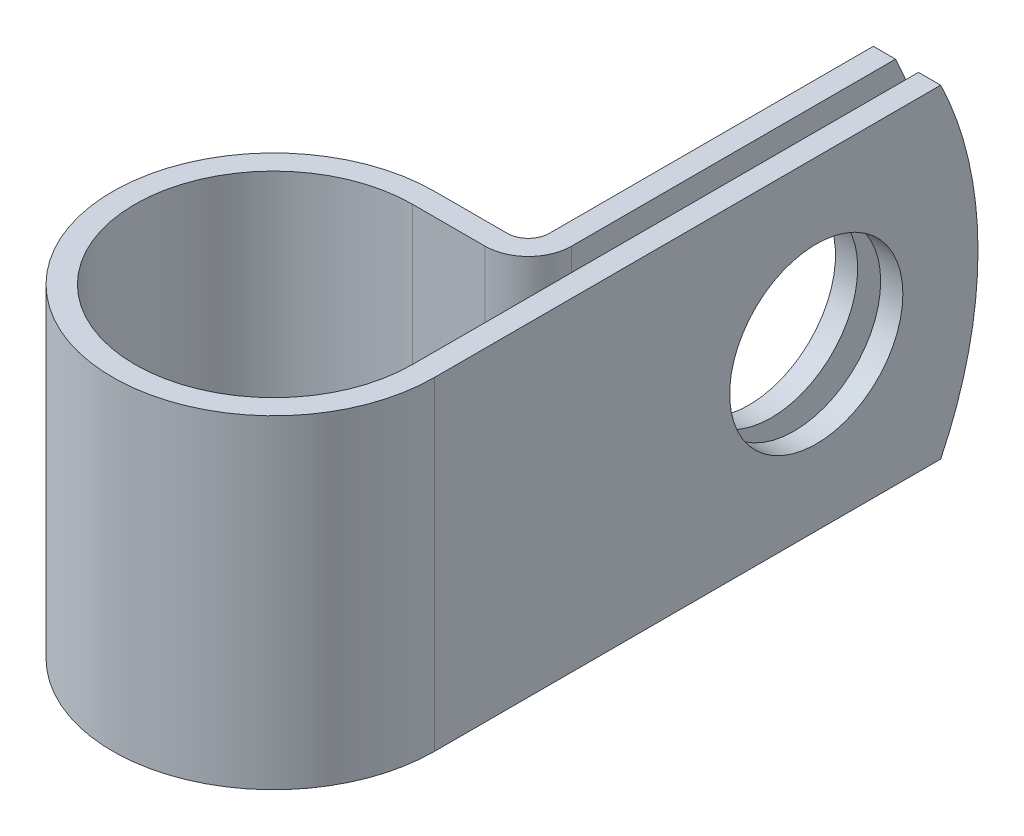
ISO-10303-21;
HEADER;
FILE_DESCRIPTION(('STEP AP214'),'2;1');
FILE_NAME('part.step','',(''),(''),'','','');
FILE_SCHEMA(('AUTOMOTIVE_DESIGN { 1 0 10303 214 1 1 1 1 }'));
ENDSEC;
DATA;
#1=APPLICATION_CONTEXT('core data for automotive mechanical design processes');
#2=APPLICATION_PROTOCOL_DEFINITION('international standard','automotive_design',2000,#1);
#3=PRODUCT_CONTEXT('',#1,'mechanical');
#4=PRODUCT('Part','Part','',(#3));
#5=PRODUCT_RELATED_PRODUCT_CATEGORY('part','',(#4));
#6=PRODUCT_DEFINITION_FORMATION('','',#4);
#7=PRODUCT_DEFINITION_CONTEXT('part definition',#1,'design');
#8=PRODUCT_DEFINITION('design','',#6,#7);
#9=PRODUCT_DEFINITION_SHAPE('','',#8);
#10=(LENGTH_UNIT() NAMED_UNIT(*) SI_UNIT(.MILLI.,.METRE.));
#11=(NAMED_UNIT(*) PLANE_ANGLE_UNIT() SI_UNIT($,.RADIAN.));
#12=(NAMED_UNIT(*) SI_UNIT($,.STERADIAN.) SOLID_ANGLE_UNIT());
#13=UNCERTAINTY_MEASURE_WITH_UNIT(LENGTH_MEASURE(1.E-05),#10,'distance_accuracy_value','');
#14=(GEOMETRIC_REPRESENTATION_CONTEXT(3) GLOBAL_UNCERTAINTY_ASSIGNED_CONTEXT((#13)) GLOBAL_UNIT_ASSIGNED_CONTEXT((#10,
#11,#12)) REPRESENTATION_CONTEXT('',''));
#15=CARTESIAN_POINT('',(0.,0.,0.));
#16=DIRECTION('',(0.,0.,1.));
#17=DIRECTION('',(1.,0.,0.));
#18=AXIS2_PLACEMENT_3D('',#15,#16,#17);
#19=CARTESIAN_POINT('',(9.525,11.1125,0.));
#20=DIRECTION('',(-1.,0.,0.));
#21=DIRECTION('',(0.,0.,1.));
#22=AXIS2_PLACEMENT_3D('',#19,#20,#21);
#23=PLANE('',#22);
#24=CARTESIAN_POINT('',(9.525,0.,-26.1874));
#25=DIRECTION('',(-1.,0.,0.));
#26=DIRECTION('',(0.,0.,1.));
#27=AXIS2_PLACEMENT_3D('',#24,#25,#26);
#28=CIRCLE('',#27,5.9436);
#29=CARTESIAN_POINT('',(9.525,0.,-20.2438));
#30=VERTEX_POINT('',#29);
#31=EDGE_CURVE('E212',#30,#30,#28,.F.);
#32=ORIENTED_EDGE('',*,*,#31,.T.);
#33=EDGE_LOOP('',(#32));
#34=FACE_BOUND('',#33,.T.);
#35=CARTESIAN_POINT('',(9.525,0.,-11.8872));
#36=DIRECTION('',(-1.,0.,0.));
#37=DIRECTION('',(0.,0.,1.));
#38=AXIS2_PLACEMENT_3D('',#35,#36,#37);
#39=CIRCLE('',#38,25.4);
#40=CARTESIAN_POINT('',(9.525,11.1125,-34.7273476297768));
#41=VERTEX_POINT('',#40);
#42=CARTESIAN_POINT('',(9.525,-11.1125,-34.7273476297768));
#43=VERTEX_POINT('',#42);
#44=EDGE_CURVE('E75',#41,#43,#39,.T.);
#45=ORIENTED_EDGE('',*,*,#44,.T.);
#46=DIRECTION('',(0.,0.,-1.));
#47=VECTOR('',#46,1.);
#48=CARTESIAN_POINT('',(9.525,-11.1125,0.));
#49=LINE('',#48,#47);
#50=CARTESIAN_POINT('',(9.525,-11.1125,0.));
#51=VERTEX_POINT('',#50);
#52=EDGE_CURVE('E221',#51,#43,#49,.T.);
#53=ORIENTED_EDGE('',*,*,#52,.F.);
#54=DIRECTION('',(0.,-1.,0.));
#55=VECTOR('',#54,1.);
#56=CARTESIAN_POINT('',(9.525,11.1125,0.));
#57=LINE('',#56,#55);
#58=CARTESIAN_POINT('',(9.525,11.1125,0.));
#59=VERTEX_POINT('',#58);
#60=EDGE_CURVE('E194',#59,#51,#57,.T.);
#61=ORIENTED_EDGE('',*,*,#60,.F.);
#62=DIRECTION('',(0.,0.,-1.));
#63=VECTOR('',#62,1.);
#64=CARTESIAN_POINT('',(9.525,11.1125,-9.525));
#65=LINE('',#64,#63);
#66=EDGE_CURVE('E223',#59,#41,#65,.T.);
#67=ORIENTED_EDGE('',*,*,#66,.T.);
#68=EDGE_LOOP('',(#45,#53,#61,#67));
#69=FACE_BOUND('',#68,.T.);
#70=ADVANCED_FACE('F54',(#34,#69),#23,.T.);
#71=CARTESIAN_POINT('',(7.9502,11.1125,-37.2872));
#72=DIRECTION('',(1.,0.,0.));
#73=DIRECTION('',(0.,0.,-1.));
#74=AXIS2_PLACEMENT_3D('',#71,#72,#73);
#75=PLANE('',#74);
#76=CARTESIAN_POINT('',(7.9502,0.,-26.1874));
#77=DIRECTION('',(1.,0.,0.));
#78=DIRECTION('',(0.,0.,-1.));
#79=AXIS2_PLACEMENT_3D('',#76,#77,#78);
#80=CIRCLE('',#79,5.9436);
#81=CARTESIAN_POINT('',(7.9502,0.,-32.131));
#82=VERTEX_POINT('',#81);
#83=EDGE_CURVE('E218',#82,#82,#80,.F.);
#84=ORIENTED_EDGE('',*,*,#83,.T.);
#85=EDGE_LOOP('',(#84));
#86=FACE_BOUND('',#85,.T.);
#87=DIRECTION('',(0.,0.,1.));
#88=VECTOR('',#87,1.);
#89=CARTESIAN_POINT('',(7.9502,-11.1125,-37.2872));
#90=LINE('',#89,#88);
#91=CARTESIAN_POINT('',(7.9502,-11.1125,-34.7273476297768));
#92=VERTEX_POINT('',#91);
#93=CARTESIAN_POINT('',(7.9502,-11.1125,-12.4968));
#94=VERTEX_POINT('',#93);
#95=EDGE_CURVE('E160',#92,#94,#90,.T.);
#96=ORIENTED_EDGE('',*,*,#95,.F.);
#97=CARTESIAN_POINT('',(7.9502,0.,-11.8872));
#98=DIRECTION('',(1.,0.,0.));
#99=DIRECTION('',(0.,0.,-1.));
#100=AXIS2_PLACEMENT_3D('',#97,#98,#99);
#101=CIRCLE('',#100,25.4);
#102=CARTESIAN_POINT('',(7.9502,11.1125,-34.7273476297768));
#103=VERTEX_POINT('',#102);
#104=EDGE_CURVE('E152',#92,#103,#101,.T.);
#105=ORIENTED_EDGE('',*,*,#104,.T.);
#106=DIRECTION('',(0.,0.,1.));
#107=VECTOR('',#106,1.);
#108=CARTESIAN_POINT('',(7.9502,11.1125,-37.2872));
#109=LINE('',#108,#107);
#110=CARTESIAN_POINT('',(7.9502,11.1125,-12.4968));
#111=VERTEX_POINT('',#110);
#112=EDGE_CURVE('E200',#103,#111,#109,.T.);
#113=ORIENTED_EDGE('',*,*,#112,.T.);
#114=DIRECTION('',(0.,-1.,0.));
#115=VECTOR('',#114,1.);
#116=CARTESIAN_POINT('',(7.9502,11.1125,-12.4968));
#117=LINE('',#116,#115);
#118=EDGE_CURVE('E187',#111,#94,#117,.T.);
#119=ORIENTED_EDGE('',*,*,#118,.T.);
#120=EDGE_LOOP('',(#96,#105,#113,#119));
#121=FACE_BOUND('',#120,.T.);
#122=ADVANCED_FACE('F202',(#86,#121),#75,.T.);
#123=CARTESIAN_POINT('',(6.4262,11.1125,-37.2872));
#124=DIRECTION('',(1.,0.,0.));
#125=DIRECTION('',(0.,0.,-1.));
#126=AXIS2_PLACEMENT_3D('',#123,#124,#125);
#127=PLANE('',#126);
#128=CARTESIAN_POINT('',(6.42620000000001,0.,-26.1874));
#129=DIRECTION('',(-1.,0.,0.));
#130=DIRECTION('',(0.,0.,1.));
#131=AXIS2_PLACEMENT_3D('',#128,#129,#130);
#132=CIRCLE('',#131,5.9436);
#133=CARTESIAN_POINT('',(6.42620000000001,0.,-20.2438));
#134=VERTEX_POINT('',#133);
#135=EDGE_CURVE('E215',#134,#134,#132,.T.);
#136=ORIENTED_EDGE('',*,*,#135,.F.);
#137=EDGE_LOOP('',(#136));
#138=FACE_BOUND('',#137,.T.);
#139=CARTESIAN_POINT('',(6.42620000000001,0.,-11.8872));
#140=DIRECTION('',(-1.,0.,0.));
#141=DIRECTION('',(0.,0.,1.));
#142=AXIS2_PLACEMENT_3D('',#139,#140,#141);
#143=CIRCLE('',#142,25.4);
#144=CARTESIAN_POINT('',(6.4262,11.1125,-34.7273476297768));
#145=VERTEX_POINT('',#144);
#146=CARTESIAN_POINT('',(6.4262,-11.1125,-34.7273476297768));
#147=VERTEX_POINT('',#146);
#148=EDGE_CURVE('E67',#145,#147,#143,.T.);
#149=ORIENTED_EDGE('',*,*,#148,.T.);
#150=DIRECTION('',(0.,0.,1.));
#151=VECTOR('',#150,1.);
#152=CARTESIAN_POINT('',(6.4262,-11.1125,-37.2872));
#153=LINE('',#152,#151);
#154=CARTESIAN_POINT('',(6.42620000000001,-11.1125,-12.4968));
#155=VERTEX_POINT('',#154);
#156=EDGE_CURVE('E143',#147,#155,#153,.T.);
#157=ORIENTED_EDGE('',*,*,#156,.T.);
#158=DIRECTION('',(0.,-1.,0.));
#159=VECTOR('',#158,1.);
#160=CARTESIAN_POINT('',(6.42620000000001,11.1125,-12.4968));
#161=LINE('',#160,#159);
#162=CARTESIAN_POINT('',(6.42620000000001,11.1125,-12.4968));
#163=VERTEX_POINT('',#162);
#164=EDGE_CURVE('E185',#163,#155,#161,.T.);
#165=ORIENTED_EDGE('',*,*,#164,.F.);
#166=DIRECTION('',(0.,0.,1.));
#167=VECTOR('',#166,1.);
#168=CARTESIAN_POINT('',(6.4262,11.1125,-37.2872));
#169=LINE('',#168,#167);
#170=EDGE_CURVE('E145',#145,#163,#169,.T.);
#171=ORIENTED_EDGE('',*,*,#170,.F.);
#172=EDGE_LOOP('',(#149,#157,#165,#171));
#173=FACE_BOUND('',#172,.T.);
#174=ADVANCED_FACE('F140',(#138,#173),#127,.F.);
#175=CARTESIAN_POINT('',(11.049,11.1125,0.));
#176=DIRECTION('',(-1.,0.,0.));
#177=DIRECTION('',(0.,0.,1.));
#178=AXIS2_PLACEMENT_3D('',#175,#176,#177);
#179=PLANE('',#178);
#180=CARTESIAN_POINT('',(11.049,0.,-26.1874));
#181=DIRECTION('',(1.,0.,0.));
#182=DIRECTION('',(0.,0.,-1.));
#183=AXIS2_PLACEMENT_3D('',#180,#181,#182);
#184=CIRCLE('',#183,5.9436);
#185=CARTESIAN_POINT('',(11.049,0.,-32.131));
#186=VERTEX_POINT('',#185);
#187=EDGE_CURVE('E206',#186,#186,#184,.T.);
#188=ORIENTED_EDGE('',*,*,#187,.F.);
#189=EDGE_LOOP('',(#188));
#190=FACE_BOUND('',#189,.T.);
#191=DIRECTION('',(0.,0.,-1.));
#192=VECTOR('',#191,1.);
#193=CARTESIAN_POINT('',(11.049,-11.1125,0.));
#194=LINE('',#193,#192);
#195=CARTESIAN_POINT('',(11.049,-11.1125,0.));
#196=VERTEX_POINT('',#195);
#197=CARTESIAN_POINT('',(11.049,-11.1125,-34.7273476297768));
#198=VERTEX_POINT('',#197);
#199=EDGE_CURVE('E171',#196,#198,#194,.T.);
#200=ORIENTED_EDGE('',*,*,#199,.T.);
#201=CARTESIAN_POINT('',(11.049,0.,-11.8872));
#202=DIRECTION('',(-1.,0.,0.));
#203=DIRECTION('',(0.,0.,1.));
#204=AXIS2_PLACEMENT_3D('',#201,#202,#203);
#205=CIRCLE('',#204,25.4);
#206=CARTESIAN_POINT('',(11.049,11.1125,-34.7273476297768));
#207=VERTEX_POINT('',#206);
#208=EDGE_CURVE('E146',#207,#198,#205,.T.);
#209=ORIENTED_EDGE('',*,*,#208,.F.);
#210=DIRECTION('',(0.,0.,-1.));
#211=VECTOR('',#210,1.);
#212=CARTESIAN_POINT('',(11.049,11.1125,-9.525));
#213=LINE('',#212,#211);
#214=CARTESIAN_POINT('',(11.049,11.1125,0.));
#215=VERTEX_POINT('',#214);
#216=EDGE_CURVE('E174',#215,#207,#213,.T.);
#217=ORIENTED_EDGE('',*,*,#216,.F.);
#218=DIRECTION('',(0.,-1.,0.));
#219=VECTOR('',#218,1.);
#220=CARTESIAN_POINT('',(11.049,11.1125,0.));
#221=LINE('',#220,#219);
#222=EDGE_CURVE('E175',#215,#196,#221,.T.);
#223=ORIENTED_EDGE('',*,*,#222,.T.);
#224=EDGE_LOOP('',(#200,#209,#217,#223));
#225=FACE_BOUND('',#224,.T.);
#226=ADVANCED_FACE('F271',(#190,#225),#179,.F.);
#227=CARTESIAN_POINT('',(0.,-11.1125,0.));
#228=DIRECTION('',(0.,1.,0.));
#229=DIRECTION('',(1.,0.,0.));
#230=AXIS2_PLACEMENT_3D('',#227,#228,#229);
#231=PLANE('',#230);
#232=DIRECTION('',(-1.,0.,0.));
#233=VECTOR('',#232,1.);
#234=CARTESIAN_POINT('',(11.049,-11.1125,-34.7273476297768));
#235=LINE('',#234,#233);
#236=EDGE_CURVE('E147',#198,#43,#235,.T.);
#237=ORIENTED_EDGE('',*,*,#236,.F.);
#238=ORIENTED_EDGE('',*,*,#199,.F.);
#239=CARTESIAN_POINT('',(0.,-11.1125,0.));
#240=DIRECTION('',(0.,1.,0.));
#241=DIRECTION('',(1.,0.,0.));
#242=AXIS2_PLACEMENT_3D('',#239,#240,#241);
#243=CIRCLE('',#242,11.049);
#244=CARTESIAN_POINT('',(0.,-11.1125,-11.049));
#245=VERTEX_POINT('',#244);
#246=EDGE_CURVE('E169',#245,#196,#243,.T.);
#247=ORIENTED_EDGE('',*,*,#246,.F.);
#248=DIRECTION('',(1.,0.,0.));
#249=VECTOR('',#248,1.);
#250=CARTESIAN_POINT('',(0.,-11.1125,-11.049));
#251=LINE('',#250,#249);
#252=CARTESIAN_POINT('',(4.9784,-11.1125,-11.049));
#253=VERTEX_POINT('',#252);
#254=EDGE_CURVE('E162',#253,#245,#251,.F.);
#255=ORIENTED_EDGE('',*,*,#254,.F.);
#256=CARTESIAN_POINT('',(4.9784,-11.1125,-12.4968));
#257=DIRECTION('',(0.,1.,0.));
#258=DIRECTION('',(1.,0.,0.));
#259=AXIS2_PLACEMENT_3D('',#256,#257,#258);
#260=CIRCLE('',#259,1.4478);
#261=EDGE_CURVE('E159',#155,#253,#260,.F.);
#262=ORIENTED_EDGE('',*,*,#261,.F.);
#263=ORIENTED_EDGE('',*,*,#156,.F.);
#264=DIRECTION('',(-1.,0.,0.));
#265=VECTOR('',#264,1.);
#266=CARTESIAN_POINT('',(11.049,-11.1125,-34.7273476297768));
#267=LINE('',#266,#265);
#268=EDGE_CURVE('E12',#92,#147,#267,.T.);
#269=ORIENTED_EDGE('',*,*,#268,.F.);
#270=ORIENTED_EDGE('',*,*,#95,.T.);
#271=CARTESIAN_POINT('',(4.9784,-11.1125,-12.4968));
#272=DIRECTION('',(0.,-1.,0.));
#273=DIRECTION('',(0.,0.,1.));
#274=AXIS2_PLACEMENT_3D('',#271,#272,#273);
#275=CIRCLE('',#274,2.9718);
#276=CARTESIAN_POINT('',(4.9784,-11.1125,-9.525));
#277=VERTEX_POINT('',#276);
#278=EDGE_CURVE('E164',#94,#277,#275,.T.);
#279=ORIENTED_EDGE('',*,*,#278,.T.);
#280=DIRECTION('',(-1.,0.,0.));
#281=VECTOR('',#280,1.);
#282=CARTESIAN_POINT('',(0.,-11.1125,-9.525));
#283=LINE('',#282,#281);
#284=CARTESIAN_POINT('',(0.,-11.1125,-9.525));
#285=VERTEX_POINT('',#284);
#286=EDGE_CURVE('E248',#277,#285,#283,.T.);
#287=ORIENTED_EDGE('',*,*,#286,.T.);
#288=CARTESIAN_POINT('',(0.,-11.1125,0.));
#289=DIRECTION('',(0.,1.,0.));
#290=DIRECTION('',(0.,0.,1.));
#291=AXIS2_PLACEMENT_3D('',#288,#289,#290);
#292=CIRCLE('',#291,9.525);
#293=EDGE_CURVE('E245',#285,#51,#292,.T.);
#294=ORIENTED_EDGE('',*,*,#293,.T.);
#295=ORIENTED_EDGE('',*,*,#52,.T.);
#296=EDGE_LOOP('',(#237,#238,#247,#255,#262,#263,#269,#270,#279,#287,#294,#295));
#297=FACE_BOUND('',#296,.T.);
#298=ADVANCED_FACE('F157',(#297),#231,.F.);
#299=CARTESIAN_POINT('',(0.,11.1125,0.));
#300=DIRECTION('',(0.,1.,0.));
#301=DIRECTION('',(1.,0.,0.));
#302=AXIS2_PLACEMENT_3D('',#299,#300,#301);
#303=PLANE('',#302);
#304=ORIENTED_EDGE('',*,*,#216,.T.);
#305=DIRECTION('',(-1.,0.,0.));
#306=VECTOR('',#305,1.);
#307=CARTESIAN_POINT('',(11.049,11.1125,-34.7273476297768));
#308=LINE('',#307,#306);
#309=EDGE_CURVE('E204',#207,#41,#308,.T.);
#310=ORIENTED_EDGE('',*,*,#309,.T.);
#311=ORIENTED_EDGE('',*,*,#66,.F.);
#312=CARTESIAN_POINT('',(0.,11.1125,0.));
#313=DIRECTION('',(0.,1.,0.));
#314=DIRECTION('',(0.,0.,1.));
#315=AXIS2_PLACEMENT_3D('',#312,#313,#314);
#316=CIRCLE('',#315,9.525);
#317=CARTESIAN_POINT('',(0.,11.1125,-9.525));
#318=VERTEX_POINT('',#317);
#319=EDGE_CURVE('E226',#318,#59,#316,.T.);
#320=ORIENTED_EDGE('',*,*,#319,.F.);
#321=DIRECTION('',(-1.,0.,0.));
#322=VECTOR('',#321,1.);
#323=CARTESIAN_POINT('',(0.,11.1125,-9.525));
#324=LINE('',#323,#322);
#325=CARTESIAN_POINT('',(4.9784,11.1125,-9.525));
#326=VERTEX_POINT('',#325);
#327=EDGE_CURVE('E229',#326,#318,#324,.T.);
#328=ORIENTED_EDGE('',*,*,#327,.F.);
#329=CARTESIAN_POINT('',(4.9784,11.1125,-12.4968));
#330=DIRECTION('',(0.,-1.,0.));
#331=DIRECTION('',(0.,0.,1.));
#332=AXIS2_PLACEMENT_3D('',#329,#330,#331);
#333=CIRCLE('',#332,2.9718);
#334=EDGE_CURVE('E232',#111,#326,#333,.T.);
#335=ORIENTED_EDGE('',*,*,#334,.F.);
#336=ORIENTED_EDGE('',*,*,#112,.F.);
#337=DIRECTION('',(-1.,0.,0.));
#338=VECTOR('',#337,1.);
#339=CARTESIAN_POINT('',(11.049,11.1125,-34.7273476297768));
#340=LINE('',#339,#338);
#341=EDGE_CURVE('E61',#103,#145,#340,.T.);
#342=ORIENTED_EDGE('',*,*,#341,.T.);
#343=ORIENTED_EDGE('',*,*,#170,.T.);
#344=CARTESIAN_POINT('',(4.9784,11.1125,-12.4968));
#345=DIRECTION('',(0.,1.,0.));
#346=DIRECTION('',(1.,0.,0.));
#347=AXIS2_PLACEMENT_3D('',#344,#345,#346);
#348=CIRCLE('',#347,1.4478);
#349=CARTESIAN_POINT('',(4.9784,11.1125,-11.049));
#350=VERTEX_POINT('',#349);
#351=EDGE_CURVE('E237',#163,#350,#348,.F.);
#352=ORIENTED_EDGE('',*,*,#351,.T.);
#353=DIRECTION('',(1.,0.,0.));
#354=VECTOR('',#353,1.);
#355=CARTESIAN_POINT('',(0.,11.1125,-11.049));
#356=LINE('',#355,#354);
#357=CARTESIAN_POINT('',(0.,11.1125,-11.049));
#358=VERTEX_POINT('',#357);
#359=EDGE_CURVE('E239',#350,#358,#356,.F.);
#360=ORIENTED_EDGE('',*,*,#359,.T.);
#361=CARTESIAN_POINT('',(0.,11.1125,0.));
#362=DIRECTION('',(0.,1.,0.));
#363=DIRECTION('',(1.,0.,0.));
#364=AXIS2_PLACEMENT_3D('',#361,#362,#363);
#365=CIRCLE('',#364,11.049);
#366=EDGE_CURVE('E179',#358,#215,#365,.T.);
#367=ORIENTED_EDGE('',*,*,#366,.T.);
#368=EDGE_LOOP('',(#304,#310,#311,#320,#328,#335,#336,#342,#343,#352,#360,#367));
#369=FACE_BOUND('',#368,.T.);
#370=ADVANCED_FACE('F198',(#369),#303,.T.);
#371=CARTESIAN_POINT('',(0.,11.1125,0.));
#372=DIRECTION('',(0.,-1.,0.));
#373=DIRECTION('',(0.,0.,-1.));
#374=AXIS2_PLACEMENT_3D('',#371,#372,#373);
#375=CYLINDRICAL_SURFACE('',#374,9.525);
#376=ORIENTED_EDGE('',*,*,#293,.F.);
#377=DIRECTION('',(0.,-1.,0.));
#378=VECTOR('',#377,1.);
#379=CARTESIAN_POINT('',(0.,11.1125,-9.525));
#380=LINE('',#379,#378);
#381=EDGE_CURVE('E192',#318,#285,#380,.T.);
#382=ORIENTED_EDGE('',*,*,#381,.F.);
#383=ORIENTED_EDGE('',*,*,#319,.T.);
#384=ORIENTED_EDGE('',*,*,#60,.T.);
#385=EDGE_LOOP('',(#376,#382,#383,#384));
#386=FACE_BOUND('',#385,.T.);
#387=ADVANCED_FACE('F261',(#386),#375,.F.);
#388=CARTESIAN_POINT('',(0.,11.1125,-9.525));
#389=DIRECTION('',(0.,0.,1.));
#390=DIRECTION('',(1.,0.,0.));
#391=AXIS2_PLACEMENT_3D('',#388,#389,#390);
#392=PLANE('',#391);
#393=ORIENTED_EDGE('',*,*,#286,.F.);
#394=DIRECTION('',(0.,-1.,0.));
#395=VECTOR('',#394,1.);
#396=CARTESIAN_POINT('',(4.9784,11.1125,-9.525));
#397=LINE('',#396,#395);
#398=EDGE_CURVE('E190',#326,#277,#397,.T.);
#399=ORIENTED_EDGE('',*,*,#398,.F.);
#400=ORIENTED_EDGE('',*,*,#327,.T.);
#401=ORIENTED_EDGE('',*,*,#381,.T.);
#402=EDGE_LOOP('',(#393,#399,#400,#401));
#403=FACE_BOUND('',#402,.T.);
#404=ADVANCED_FACE('F257',(#403),#392,.T.);
#405=CARTESIAN_POINT('',(4.9784,11.1125,-12.4968));
#406=DIRECTION('',(0.,-1.,0.));
#407=DIRECTION('',(0.,0.,-1.));
#408=AXIS2_PLACEMENT_3D('',#405,#406,#407);
#409=CYLINDRICAL_SURFACE('',#408,2.9718);
#410=ORIENTED_EDGE('',*,*,#278,.F.);
#411=ORIENTED_EDGE('',*,*,#118,.F.);
#412=ORIENTED_EDGE('',*,*,#334,.T.);
#413=ORIENTED_EDGE('',*,*,#398,.T.);
#414=EDGE_LOOP('',(#410,#411,#412,#413));
#415=FACE_BOUND('',#414,.T.);
#416=ADVANCED_FACE('F254',(#415),#409,.T.);
#417=CARTESIAN_POINT('',(4.9784,11.1125,-12.4968));
#418=DIRECTION('',(0.,-1.,0.));
#419=DIRECTION('',(0.,0.,-1.));
#420=AXIS2_PLACEMENT_3D('',#417,#418,#419);
#421=CYLINDRICAL_SURFACE('',#420,1.4478);
#422=ORIENTED_EDGE('',*,*,#261,.T.);
#423=DIRECTION('',(0.,-1.,0.));
#424=VECTOR('',#423,1.);
#425=CARTESIAN_POINT('',(4.9784,11.1125,-11.049));
#426=LINE('',#425,#424);
#427=EDGE_CURVE('E182',#350,#253,#426,.T.);
#428=ORIENTED_EDGE('',*,*,#427,.F.);
#429=ORIENTED_EDGE('',*,*,#351,.F.);
#430=ORIENTED_EDGE('',*,*,#164,.T.);
#431=EDGE_LOOP('',(#422,#428,#429,#430));
#432=FACE_BOUND('',#431,.T.);
#433=ADVANCED_FACE('F284',(#432),#421,.F.);
#434=CARTESIAN_POINT('',(0.,11.1125,-11.049));
#435=DIRECTION('',(0.,0.,1.));
#436=DIRECTION('',(1.,0.,0.));
#437=AXIS2_PLACEMENT_3D('',#434,#435,#436);
#438=PLANE('',#437);
#439=ORIENTED_EDGE('',*,*,#254,.T.);
#440=DIRECTION('',(0.,-1.,0.));
#441=VECTOR('',#440,1.);
#442=CARTESIAN_POINT('',(0.,11.1125,-11.049));
#443=LINE('',#442,#441);
#444=EDGE_CURVE('E178',#358,#245,#443,.T.);
#445=ORIENTED_EDGE('',*,*,#444,.F.);
#446=ORIENTED_EDGE('',*,*,#359,.F.);
#447=ORIENTED_EDGE('',*,*,#427,.T.);
#448=EDGE_LOOP('',(#439,#445,#446,#447));
#449=FACE_BOUND('',#448,.T.);
#450=ADVANCED_FACE('F280',(#449),#438,.F.);
#451=CARTESIAN_POINT('',(0.,11.1125,0.));
#452=DIRECTION('',(0.,-1.,0.));
#453=DIRECTION('',(0.,0.,-1.));
#454=AXIS2_PLACEMENT_3D('',#451,#452,#453);
#455=CYLINDRICAL_SURFACE('',#454,11.049);
#456=ORIENTED_EDGE('',*,*,#246,.T.);
#457=ORIENTED_EDGE('',*,*,#222,.F.);
#458=ORIENTED_EDGE('',*,*,#366,.F.);
#459=ORIENTED_EDGE('',*,*,#444,.T.);
#460=EDGE_LOOP('',(#456,#457,#458,#459));
#461=FACE_BOUND('',#460,.T.);
#462=ADVANCED_FACE('F277',(#461),#455,.T.);
#463=CARTESIAN_POINT('',(24.7612394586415,0.,-26.1874));
#464=DIRECTION('',(-1.,0.,0.));
#465=DIRECTION('',(0.,0.,1.));
#466=AXIS2_PLACEMENT_3D('',#463,#464,#465);
#467=CYLINDRICAL_SURFACE('',#466,5.9436);
#468=ORIENTED_EDGE('',*,*,#135,.T.);
#469=EDGE_LOOP('',(#468));
#470=FACE_BOUND('',#469,.T.);
#471=ORIENTED_EDGE('',*,*,#83,.F.);
#472=EDGE_LOOP('',(#471));
#473=FACE_BOUND('',#472,.T.);
#474=ADVANCED_FACE('F305',(#470,#473),#467,.F.);
#475=CARTESIAN_POINT('',(-7.28603945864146,0.,-26.1874));
#476=DIRECTION('',(1.,0.,0.));
#477=DIRECTION('',(0.,0.,-1.));
#478=AXIS2_PLACEMENT_3D('',#475,#476,#477);
#479=CYLINDRICAL_SURFACE('',#478,5.9436);
#480=ORIENTED_EDGE('',*,*,#187,.T.);
#481=EDGE_LOOP('',(#480));
#482=FACE_BOUND('',#481,.T.);
#483=ORIENTED_EDGE('',*,*,#31,.F.);
#484=EDGE_LOOP('',(#483));
#485=FACE_BOUND('',#484,.T.);
#486=ADVANCED_FACE('F303',(#482,#485),#479,.F.);
#487=CARTESIAN_POINT('',(11.049,0.,-11.8872));
#488=DIRECTION('',(-1.,0.,0.));
#489=DIRECTION('',(0.,0.,1.));
#490=AXIS2_PLACEMENT_3D('',#487,#488,#489);
#491=CYLINDRICAL_SURFACE('',#490,25.4);
#492=ORIENTED_EDGE('',*,*,#104,.F.);
#493=ORIENTED_EDGE('',*,*,#268,.T.);
#494=ORIENTED_EDGE('',*,*,#148,.F.);
#495=ORIENTED_EDGE('',*,*,#341,.F.);
#496=EDGE_LOOP('',(#492,#493,#494,#495));
#497=FACE_BOUND('',#496,.T.);
#498=ADVANCED_FACE('F150',(#497),#491,.T.);
#499=ORIENTED_EDGE('',*,*,#309,.F.);
#500=ORIENTED_EDGE('',*,*,#208,.T.);
#501=ORIENTED_EDGE('',*,*,#236,.T.);
#502=ORIENTED_EDGE('',*,*,#44,.F.);
#503=EDGE_LOOP('',(#499,#500,#501,#502));
#504=FACE_BOUND('',#503,.T.);
#505=ADVANCED_FACE('F266',(#504),#491,.T.);
#506=CLOSED_SHELL('',(#70,#122,#174,#226,#298,#370,#387,#404,#416,#433,#450,#462,#474,#486,#498,#505));
#507=MANIFOLD_SOLID_BREP('B2',#506);
#508=ADVANCED_BREP_SHAPE_REPRESENTATION('',(#18,#507),#14);
#509=SHAPE_DEFINITION_REPRESENTATION(#9,#508);
ENDSEC;
END-ISO-10303-21;
